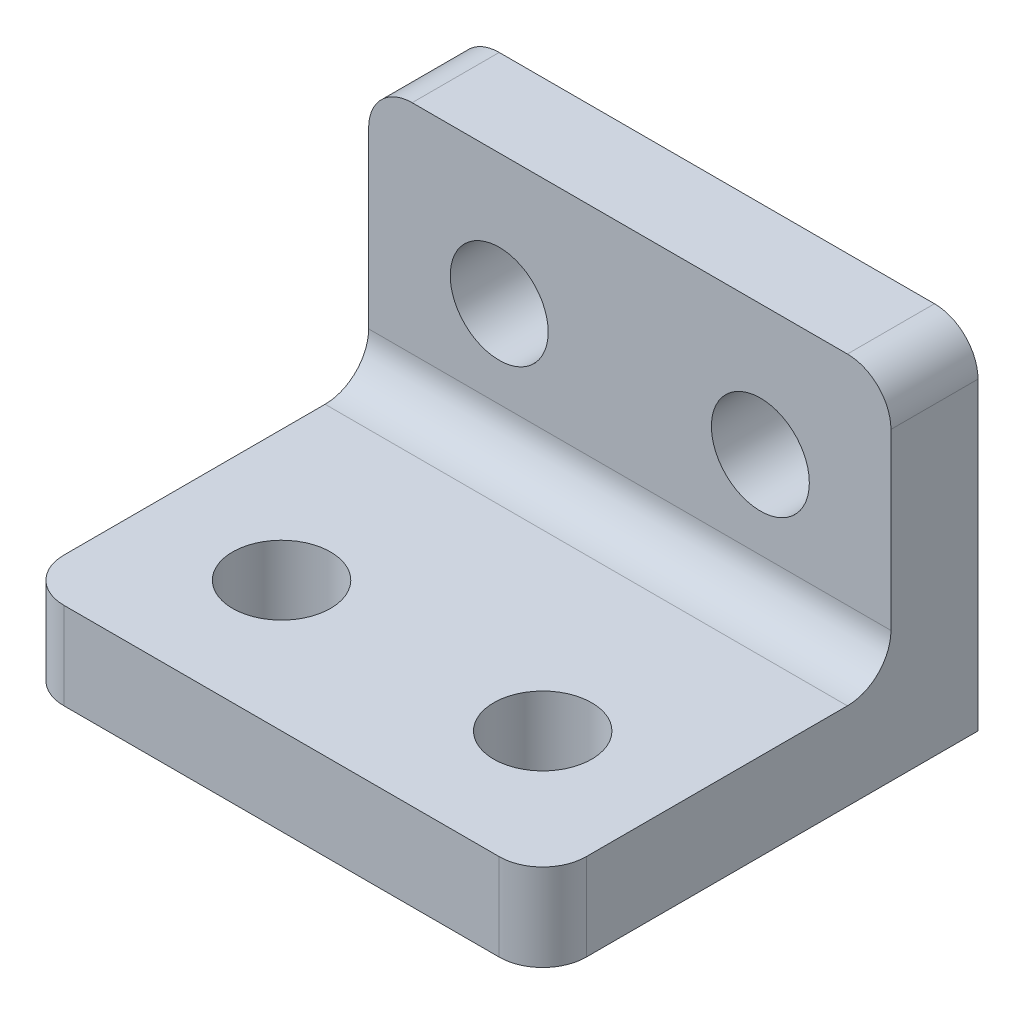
ISO-10303-21;
HEADER;
FILE_DESCRIPTION(('STEP AP214'),'2;1');
FILE_NAME('part.step','',(''),(''),'','','');
FILE_SCHEMA(('AUTOMOTIVE_DESIGN { 1 0 10303 214 1 1 1 1 }'));
ENDSEC;
DATA;
#1=APPLICATION_CONTEXT('core data for automotive mechanical design processes');
#2=APPLICATION_PROTOCOL_DEFINITION('international standard','automotive_design',2000,#1);
#3=PRODUCT_CONTEXT('',#1,'mechanical');
#4=PRODUCT('Part','Part','',(#3));
#5=PRODUCT_RELATED_PRODUCT_CATEGORY('part','',(#4));
#6=PRODUCT_DEFINITION_FORMATION('','',#4);
#7=PRODUCT_DEFINITION_CONTEXT('part definition',#1,'design');
#8=PRODUCT_DEFINITION('design','',#6,#7);
#9=PRODUCT_DEFINITION_SHAPE('','',#8);
#10=(LENGTH_UNIT() NAMED_UNIT(*) SI_UNIT(.MILLI.,.METRE.));
#11=(NAMED_UNIT(*) PLANE_ANGLE_UNIT() SI_UNIT($,.RADIAN.));
#12=(NAMED_UNIT(*) SI_UNIT($,.STERADIAN.) SOLID_ANGLE_UNIT());
#13=UNCERTAINTY_MEASURE_WITH_UNIT(LENGTH_MEASURE(1.E-05),#10,'distance_accuracy_value','');
#14=(GEOMETRIC_REPRESENTATION_CONTEXT(3) GLOBAL_UNCERTAINTY_ASSIGNED_CONTEXT((#13)) GLOBAL_UNIT_ASSIGNED_CONTEXT((#10,
#11,#12)) REPRESENTATION_CONTEXT('',''));
#15=CARTESIAN_POINT('',(0.,0.,0.));
#16=DIRECTION('',(0.,0.,1.));
#17=DIRECTION('',(1.,0.,0.));
#18=AXIS2_PLACEMENT_3D('',#15,#16,#17);
#19=CARTESIAN_POINT('',(0.,0.,6.35));
#20=DIRECTION('',(0.,0.,-1.));
#21=DIRECTION('',(-1.,0.,0.));
#22=AXIS2_PLACEMENT_3D('',#19,#20,#21);
#23=PLANE('',#22);
#24=CARTESIAN_POINT('',(9.525,3.175,6.35));
#25=DIRECTION('',(0.,0.,1.));
#26=DIRECTION('',(1.,0.,0.));
#27=AXIS2_PLACEMENT_3D('',#24,#25,#26);
#28=CIRCLE('',#27,3.571875);
#29=CARTESIAN_POINT('',(13.096875,3.175,6.35));
#30=VERTEX_POINT('',#29);
#31=EDGE_CURVE('E246',#30,#30,#28,.T.);
#32=ORIENTED_EDGE('',*,*,#31,.F.);
#33=EDGE_LOOP('',(#32));
#34=FACE_BOUND('',#33,.T.);
#35=CARTESIAN_POINT('',(-9.525,3.175,6.35));
#36=DIRECTION('',(0.,0.,1.));
#37=DIRECTION('',(1.,0.,0.));
#38=AXIS2_PLACEMENT_3D('',#35,#36,#37);
#39=CIRCLE('',#38,3.571875);
#40=CARTESIAN_POINT('',(-5.95312500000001,3.175,6.35));
#41=VERTEX_POINT('',#40);
#42=EDGE_CURVE('E256',#41,#41,#39,.T.);
#43=ORIENTED_EDGE('',*,*,#42,.F.);
#44=EDGE_LOOP('',(#43));
#45=FACE_BOUND('',#44,.T.);
#46=DIRECTION('',(0.,-1.,0.));
#47=VECTOR('',#46,1.);
#48=CARTESIAN_POINT('',(-19.05,-12.7,6.35));
#49=LINE('',#48,#47);
#50=CARTESIAN_POINT('',(-19.05,9.525,6.35));
#51=VERTEX_POINT('',#50);
#52=CARTESIAN_POINT('',(-19.05,-3.175,6.35));
#53=VERTEX_POINT('',#52);
#54=EDGE_CURVE('E162',#51,#53,#49,.T.);
#55=ORIENTED_EDGE('',*,*,#54,.T.);
#56=DIRECTION('',(-1.,0.,0.));
#57=VECTOR('',#56,1.);
#58=CARTESIAN_POINT('',(19.05,-3.175,6.35));
#59=LINE('',#58,#57);
#60=CARTESIAN_POINT('',(19.05,-3.175,6.35));
#61=VERTEX_POINT('',#60);
#62=EDGE_CURVE('E203',#53,#61,#59,.F.);
#63=ORIENTED_EDGE('',*,*,#62,.T.);
#64=DIRECTION('',(0.,1.,0.));
#65=VECTOR('',#64,1.);
#66=CARTESIAN_POINT('',(19.05,-12.7,6.35));
#67=LINE('',#66,#65);
#68=CARTESIAN_POINT('',(19.05,9.525,6.35));
#69=VERTEX_POINT('',#68);
#70=EDGE_CURVE('E153',#61,#69,#67,.T.);
#71=ORIENTED_EDGE('',*,*,#70,.T.);
#72=CARTESIAN_POINT('',(15.875,9.525,6.35));
#73=DIRECTION('',(0.,0.,-1.));
#74=DIRECTION('',(-1.,0.,0.));
#75=AXIS2_PLACEMENT_3D('',#72,#73,#74);
#76=CIRCLE('',#75,3.175);
#77=CARTESIAN_POINT('',(15.875,12.7,6.35));
#78=VERTEX_POINT('',#77);
#79=EDGE_CURVE('E200',#69,#78,#76,.F.);
#80=ORIENTED_EDGE('',*,*,#79,.T.);
#81=DIRECTION('',(-1.,0.,0.));
#82=VECTOR('',#81,1.);
#83=CARTESIAN_POINT('',(-19.05,12.7,6.35));
#84=LINE('',#83,#82);
#85=CARTESIAN_POINT('',(-15.875,12.7,6.35));
#86=VERTEX_POINT('',#85);
#87=EDGE_CURVE('E157',#78,#86,#84,.T.);
#88=ORIENTED_EDGE('',*,*,#87,.T.);
#89=CARTESIAN_POINT('',(-15.875,9.525,6.35));
#90=DIRECTION('',(0.,0.,-1.));
#91=DIRECTION('',(-1.,0.,0.));
#92=AXIS2_PLACEMENT_3D('',#89,#90,#91);
#93=CIRCLE('',#92,3.175);
#94=EDGE_CURVE('E197',#86,#51,#93,.F.);
#95=ORIENTED_EDGE('',*,*,#94,.T.);
#96=EDGE_LOOP('',(#55,#63,#71,#80,#88,#95));
#97=FACE_BOUND('',#96,.T.);
#98=ADVANCED_FACE('F39',(#34,#45,#97),#23,.F.);
#99=CARTESIAN_POINT('',(0.,0.,0.));
#100=DIRECTION('',(0.,0.,-1.));
#101=DIRECTION('',(-1.,0.,0.));
#102=AXIS2_PLACEMENT_3D('',#99,#100,#101);
#103=PLANE('',#102);
#104=CARTESIAN_POINT('',(-9.525,3.175,0.));
#105=DIRECTION('',(0.,0.,1.));
#106=DIRECTION('',(1.,0.,0.));
#107=AXIS2_PLACEMENT_3D('',#104,#105,#106);
#108=CIRCLE('',#107,3.571875);
#109=CARTESIAN_POINT('',(-5.95312500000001,3.175,0.));
#110=VERTEX_POINT('',#109);
#111=EDGE_CURVE('E254',#110,#110,#108,.T.);
#112=ORIENTED_EDGE('',*,*,#111,.T.);
#113=EDGE_LOOP('',(#112));
#114=FACE_BOUND('',#113,.T.);
#115=DIRECTION('',(-1.,0.,0.));
#116=VECTOR('',#115,1.);
#117=CARTESIAN_POINT('',(-19.05,12.7,0.));
#118=LINE('',#117,#116);
#119=CARTESIAN_POINT('',(15.875,12.7,0.));
#120=VERTEX_POINT('',#119);
#121=CARTESIAN_POINT('',(-15.875,12.7,0.));
#122=VERTEX_POINT('',#121);
#123=EDGE_CURVE('E135',#120,#122,#118,.T.);
#124=ORIENTED_EDGE('',*,*,#123,.F.);
#125=CARTESIAN_POINT('',(15.875,9.525,0.));
#126=DIRECTION('',(0.,0.,-1.));
#127=DIRECTION('',(-1.,0.,0.));
#128=AXIS2_PLACEMENT_3D('',#125,#126,#127);
#129=CIRCLE('',#128,3.175);
#130=CARTESIAN_POINT('',(19.05,9.525,0.));
#131=VERTEX_POINT('',#130);
#132=EDGE_CURVE('E63',#120,#131,#129,.T.);
#133=ORIENTED_EDGE('',*,*,#132,.T.);
#134=DIRECTION('',(0.,1.,0.));
#135=VECTOR('',#134,1.);
#136=CARTESIAN_POINT('',(19.05,-12.7,0.));
#137=LINE('',#136,#135);
#138=CARTESIAN_POINT('',(19.05,-12.7,0.));
#139=VERTEX_POINT('',#138);
#140=EDGE_CURVE('E151',#139,#131,#137,.T.);
#141=ORIENTED_EDGE('',*,*,#140,.F.);
#142=DIRECTION('',(1.,0.,0.));
#143=VECTOR('',#142,1.);
#144=CARTESIAN_POINT('',(-19.05,-12.7,0.));
#145=LINE('',#144,#143);
#146=CARTESIAN_POINT('',(-19.05,-12.7,0.));
#147=VERTEX_POINT('',#146);
#148=EDGE_CURVE('E134',#147,#139,#145,.T.);
#149=ORIENTED_EDGE('',*,*,#148,.F.);
#150=DIRECTION('',(0.,-1.,0.));
#151=VECTOR('',#150,1.);
#152=CARTESIAN_POINT('',(-19.05,-12.7,0.));
#153=LINE('',#152,#151);
#154=CARTESIAN_POINT('',(-19.05,9.525,0.));
#155=VERTEX_POINT('',#154);
#156=EDGE_CURVE('E124',#155,#147,#153,.T.);
#157=ORIENTED_EDGE('',*,*,#156,.F.);
#158=CARTESIAN_POINT('',(-15.875,9.525,0.));
#159=DIRECTION('',(0.,0.,-1.));
#160=DIRECTION('',(-1.,0.,0.));
#161=AXIS2_PLACEMENT_3D('',#158,#159,#160);
#162=CIRCLE('',#161,3.175);
#163=EDGE_CURVE('E55',#155,#122,#162,.T.);
#164=ORIENTED_EDGE('',*,*,#163,.T.);
#165=EDGE_LOOP('',(#124,#133,#141,#149,#157,#164));
#166=FACE_BOUND('',#165,.T.);
#167=CARTESIAN_POINT('',(9.525,3.175,0.));
#168=DIRECTION('',(0.,0.,1.));
#169=DIRECTION('',(1.,0.,0.));
#170=AXIS2_PLACEMENT_3D('',#167,#168,#169);
#171=CIRCLE('',#170,3.571875);
#172=CARTESIAN_POINT('',(13.096875,3.175,0.));
#173=VERTEX_POINT('',#172);
#174=EDGE_CURVE('E241',#173,#173,#171,.T.);
#175=ORIENTED_EDGE('',*,*,#174,.T.);
#176=EDGE_LOOP('',(#175));
#177=FACE_BOUND('',#176,.T.);
#178=ADVANCED_FACE('F148',(#114,#166,#177),#103,.T.);
#179=CARTESIAN_POINT('',(19.05,-12.7,6.35));
#180=DIRECTION('',(-1.,0.,0.));
#181=DIRECTION('',(0.,0.,1.));
#182=AXIS2_PLACEMENT_3D('',#179,#180,#181);
#183=PLANE('',#182);
#184=DIRECTION('',(0.,0.,-1.));
#185=VECTOR('',#184,1.);
#186=CARTESIAN_POINT('',(19.05,-6.35,31.75));
#187=LINE('',#186,#185);
#188=CARTESIAN_POINT('',(19.05,-6.35,28.575));
#189=VERTEX_POINT('',#188);
#190=CARTESIAN_POINT('',(19.05,-6.35,9.525));
#191=VERTEX_POINT('',#190);
#192=EDGE_CURVE('E235',#189,#191,#187,.T.);
#193=ORIENTED_EDGE('',*,*,#192,.F.);
#194=DIRECTION('',(0.,1.,0.));
#195=VECTOR('',#194,1.);
#196=CARTESIAN_POINT('',(19.05,-12.7,28.575));
#197=LINE('',#196,#195);
#198=CARTESIAN_POINT('',(19.05,-12.7,28.575));
#199=VERTEX_POINT('',#198);
#200=EDGE_CURVE('E184',#189,#199,#197,.F.);
#201=ORIENTED_EDGE('',*,*,#200,.T.);
#202=DIRECTION('',(0.,0.,-1.));
#203=VECTOR('',#202,1.);
#204=CARTESIAN_POINT('',(19.05,-12.7,6.35));
#205=LINE('',#204,#203);
#206=EDGE_CURVE('E146',#199,#139,#205,.T.);
#207=ORIENTED_EDGE('',*,*,#206,.T.);
#208=ORIENTED_EDGE('',*,*,#140,.T.);
#209=DIRECTION('',(0.,0.,-1.));
#210=VECTOR('',#209,1.);
#211=CARTESIAN_POINT('',(19.05,9.525,6.35));
#212=LINE('',#211,#210);
#213=EDGE_CURVE('E181',#131,#69,#212,.F.);
#214=ORIENTED_EDGE('',*,*,#213,.T.);
#215=ORIENTED_EDGE('',*,*,#70,.F.);
#216=CARTESIAN_POINT('',(19.05,-3.175,9.525));
#217=DIRECTION('',(-1.,0.,0.));
#218=DIRECTION('',(0.,0.,1.));
#219=AXIS2_PLACEMENT_3D('',#216,#217,#218);
#220=CIRCLE('',#219,3.175);
#221=EDGE_CURVE('E11',#61,#191,#220,.T.);
#222=ORIENTED_EDGE('',*,*,#221,.T.);
#223=EDGE_LOOP('',(#193,#201,#207,#208,#214,#215,#222));
#224=FACE_BOUND('',#223,.T.);
#225=ADVANCED_FACE('F234',(#224),#183,.F.);
#226=CARTESIAN_POINT('',(-19.05,12.7,6.35));
#227=DIRECTION('',(0.,-1.,0.));
#228=DIRECTION('',(0.,0.,-1.));
#229=AXIS2_PLACEMENT_3D('',#226,#227,#228);
#230=PLANE('',#229);
#231=ORIENTED_EDGE('',*,*,#87,.F.);
#232=DIRECTION('',(0.,0.,-1.));
#233=VECTOR('',#232,1.);
#234=CARTESIAN_POINT('',(15.875,12.7,6.35));
#235=LINE('',#234,#233);
#236=EDGE_CURVE('E209',#78,#120,#235,.T.);
#237=ORIENTED_EDGE('',*,*,#236,.T.);
#238=ORIENTED_EDGE('',*,*,#123,.T.);
#239=DIRECTION('',(0.,0.,-1.));
#240=VECTOR('',#239,1.);
#241=CARTESIAN_POINT('',(-15.875,12.7,6.35));
#242=LINE('',#241,#240);
#243=EDGE_CURVE('E206',#122,#86,#242,.F.);
#244=ORIENTED_EDGE('',*,*,#243,.T.);
#245=EDGE_LOOP('',(#231,#237,#238,#244));
#246=FACE_BOUND('',#245,.T.);
#247=ADVANCED_FACE('F270',(#246),#230,.F.);
#248=CARTESIAN_POINT('',(-19.05,-12.7,6.35));
#249=DIRECTION('',(1.,0.,0.));
#250=DIRECTION('',(0.,0.,-1.));
#251=AXIS2_PLACEMENT_3D('',#248,#249,#250);
#252=PLANE('',#251);
#253=DIRECTION('',(0.,0.,-1.));
#254=VECTOR('',#253,1.);
#255=CARTESIAN_POINT('',(-19.05,-12.7,6.35));
#256=LINE('',#255,#254);
#257=CARTESIAN_POINT('',(-19.05,-12.7,28.575));
#258=VERTEX_POINT('',#257);
#259=EDGE_CURVE('E127',#258,#147,#256,.T.);
#260=ORIENTED_EDGE('',*,*,#259,.F.);
#261=DIRECTION('',(0.,-1.,0.));
#262=VECTOR('',#261,1.);
#263=CARTESIAN_POINT('',(-19.05,-12.7,28.575));
#264=LINE('',#263,#262);
#265=CARTESIAN_POINT('',(-19.05,-6.35,28.575));
#266=VERTEX_POINT('',#265);
#267=EDGE_CURVE('E194',#258,#266,#264,.F.);
#268=ORIENTED_EDGE('',*,*,#267,.T.);
#269=DIRECTION('',(0.,0.,-1.));
#270=VECTOR('',#269,1.);
#271=CARTESIAN_POINT('',(-19.05,-6.35,31.75));
#272=LINE('',#271,#270);
#273=CARTESIAN_POINT('',(-19.05,-6.35,9.525));
#274=VERTEX_POINT('',#273);
#275=EDGE_CURVE('E219',#266,#274,#272,.T.);
#276=ORIENTED_EDGE('',*,*,#275,.T.);
#277=CARTESIAN_POINT('',(-19.05,-3.175,9.525));
#278=DIRECTION('',(1.,0.,0.));
#279=DIRECTION('',(0.,0.,-1.));
#280=AXIS2_PLACEMENT_3D('',#277,#278,#279);
#281=CIRCLE('',#280,3.175);
#282=EDGE_CURVE('E48',#274,#53,#281,.T.);
#283=ORIENTED_EDGE('',*,*,#282,.T.);
#284=ORIENTED_EDGE('',*,*,#54,.F.);
#285=DIRECTION('',(0.,0.,-1.));
#286=VECTOR('',#285,1.);
#287=CARTESIAN_POINT('',(-19.05,9.525,6.35));
#288=LINE('',#287,#286);
#289=EDGE_CURVE('E131',#51,#155,#288,.T.);
#290=ORIENTED_EDGE('',*,*,#289,.T.);
#291=ORIENTED_EDGE('',*,*,#156,.T.);
#292=EDGE_LOOP('',(#260,#268,#276,#283,#284,#290,#291));
#293=FACE_BOUND('',#292,.T.);
#294=ADVANCED_FACE('F126',(#293),#252,.F.);
#295=CARTESIAN_POINT('',(-19.05,-12.7,6.35));
#296=DIRECTION('',(0.,1.,0.));
#297=DIRECTION('',(0.,0.,1.));
#298=AXIS2_PLACEMENT_3D('',#295,#296,#297);
#299=PLANE('',#298);
#300=CARTESIAN_POINT('',(-9.525,-12.7,22.225));
#301=DIRECTION('',(0.,1.,0.));
#302=DIRECTION('',(0.,0.,1.));
#303=AXIS2_PLACEMENT_3D('',#300,#301,#302);
#304=CIRCLE('',#303,3.571875);
#305=CARTESIAN_POINT('',(-9.525,-12.7,25.796875));
#306=VERTEX_POINT('',#305);
#307=EDGE_CURVE('E460',#306,#306,#304,.T.);
#308=ORIENTED_EDGE('',*,*,#307,.T.);
#309=EDGE_LOOP('',(#308));
#310=FACE_BOUND('',#309,.T.);
#311=CARTESIAN_POINT('',(9.525,-12.7,22.225));
#312=DIRECTION('',(0.,1.,0.));
#313=DIRECTION('',(0.,0.,1.));
#314=AXIS2_PLACEMENT_3D('',#311,#312,#313);
#315=CIRCLE('',#314,3.571875);
#316=CARTESIAN_POINT('',(9.525,-12.7,25.796875));
#317=VERTEX_POINT('',#316);
#318=EDGE_CURVE('E450',#317,#317,#315,.T.);
#319=ORIENTED_EDGE('',*,*,#318,.T.);
#320=EDGE_LOOP('',(#319));
#321=FACE_BOUND('',#320,.T.);
#322=ORIENTED_EDGE('',*,*,#206,.F.);
#323=CARTESIAN_POINT('',(15.875,-12.7,28.575));
#324=DIRECTION('',(0.,1.,0.));
#325=DIRECTION('',(0.,0.,1.));
#326=AXIS2_PLACEMENT_3D('',#323,#324,#325);
#327=CIRCLE('',#326,3.175);
#328=CARTESIAN_POINT('',(15.875,-12.7,31.75));
#329=VERTEX_POINT('',#328);
#330=EDGE_CURVE('E189',#199,#329,#327,.F.);
#331=ORIENTED_EDGE('',*,*,#330,.T.);
#332=DIRECTION('',(1.,0.,0.));
#333=VECTOR('',#332,1.);
#334=CARTESIAN_POINT('',(-19.05,-12.7,31.75));
#335=LINE('',#334,#333);
#336=CARTESIAN_POINT('',(-15.875,-12.7,31.75));
#337=VERTEX_POINT('',#336);
#338=EDGE_CURVE('E457',#337,#329,#335,.T.);
#339=ORIENTED_EDGE('',*,*,#338,.F.);
#340=CARTESIAN_POINT('',(-15.875,-12.7,28.575));
#341=DIRECTION('',(0.,1.,0.));
#342=DIRECTION('',(0.,0.,1.));
#343=AXIS2_PLACEMENT_3D('',#340,#341,#342);
#344=CIRCLE('',#343,3.175);
#345=EDGE_CURVE('E143',#337,#258,#344,.F.);
#346=ORIENTED_EDGE('',*,*,#345,.T.);
#347=ORIENTED_EDGE('',*,*,#259,.T.);
#348=ORIENTED_EDGE('',*,*,#148,.T.);
#349=EDGE_LOOP('',(#322,#331,#339,#346,#347,#348));
#350=FACE_BOUND('',#349,.T.);
#351=ADVANCED_FACE('F140',(#310,#321,#350),#299,.F.);
#352=CARTESIAN_POINT('',(-9.525,3.175,6.35));
#353=DIRECTION('',(0.,0.,-1.));
#354=DIRECTION('',(-1.,0.,0.));
#355=AXIS2_PLACEMENT_3D('',#352,#353,#354);
#356=CYLINDRICAL_SURFACE('',#355,3.571875);
#357=ORIENTED_EDGE('',*,*,#42,.T.);
#358=EDGE_LOOP('',(#357));
#359=FACE_BOUND('',#358,.T.);
#360=ORIENTED_EDGE('',*,*,#111,.F.);
#361=EDGE_LOOP('',(#360));
#362=FACE_BOUND('',#361,.T.);
#363=ADVANCED_FACE('F288',(#359,#362),#356,.F.);
#364=CARTESIAN_POINT('',(9.525,3.175,6.35));
#365=DIRECTION('',(0.,0.,-1.));
#366=DIRECTION('',(-1.,0.,0.));
#367=AXIS2_PLACEMENT_3D('',#364,#365,#366);
#368=CYLINDRICAL_SURFACE('',#367,3.571875);
#369=ORIENTED_EDGE('',*,*,#31,.T.);
#370=EDGE_LOOP('',(#369));
#371=FACE_BOUND('',#370,.T.);
#372=ORIENTED_EDGE('',*,*,#174,.F.);
#373=EDGE_LOOP('',(#372));
#374=FACE_BOUND('',#373,.T.);
#375=ADVANCED_FACE('F370',(#371,#374),#368,.F.);
#376=CARTESIAN_POINT('',(-19.05,-6.35,31.75));
#377=DIRECTION('',(0.,-1.,0.));
#378=DIRECTION('',(0.,0.,-1.));
#379=AXIS2_PLACEMENT_3D('',#376,#377,#378);
#380=PLANE('',#379);
#381=CARTESIAN_POINT('',(-9.525,-6.35,22.225));
#382=DIRECTION('',(0.,1.,0.));
#383=DIRECTION('',(0.,0.,1.));
#384=AXIS2_PLACEMENT_3D('',#381,#382,#383);
#385=CIRCLE('',#384,3.571875);
#386=CARTESIAN_POINT('',(-9.525,-6.35,25.796875));
#387=VERTEX_POINT('',#386);
#388=EDGE_CURVE('E444',#387,#387,#385,.T.);
#389=ORIENTED_EDGE('',*,*,#388,.F.);
#390=EDGE_LOOP('',(#389));
#391=FACE_BOUND('',#390,.T.);
#392=CARTESIAN_POINT('',(9.525,-6.35,22.225));
#393=DIRECTION('',(0.,1.,0.));
#394=DIRECTION('',(0.,0.,1.));
#395=AXIS2_PLACEMENT_3D('',#392,#393,#394);
#396=CIRCLE('',#395,3.571875);
#397=CARTESIAN_POINT('',(9.525,-6.35,25.796875));
#398=VERTEX_POINT('',#397);
#399=EDGE_CURVE('E447',#398,#398,#396,.T.);
#400=ORIENTED_EDGE('',*,*,#399,.F.);
#401=EDGE_LOOP('',(#400));
#402=FACE_BOUND('',#401,.T.);
#403=DIRECTION('',(-1.,0.,0.));
#404=VECTOR('',#403,1.);
#405=CARTESIAN_POINT('',(-19.05,-6.35,31.75));
#406=LINE('',#405,#404);
#407=CARTESIAN_POINT('',(15.875,-6.35,31.75));
#408=VERTEX_POINT('',#407);
#409=CARTESIAN_POINT('',(-15.875,-6.35,31.75));
#410=VERTEX_POINT('',#409);
#411=EDGE_CURVE('E248',#408,#410,#406,.T.);
#412=ORIENTED_EDGE('',*,*,#411,.F.);
#413=CARTESIAN_POINT('',(15.875,-6.35,28.575));
#414=DIRECTION('',(0.,-1.,0.));
#415=DIRECTION('',(0.,0.,-1.));
#416=AXIS2_PLACEMENT_3D('',#413,#414,#415);
#417=CIRCLE('',#416,3.175);
#418=EDGE_CURVE('E178',#408,#189,#417,.F.);
#419=ORIENTED_EDGE('',*,*,#418,.T.);
#420=ORIENTED_EDGE('',*,*,#192,.T.);
#421=DIRECTION('',(-1.,0.,0.));
#422=VECTOR('',#421,1.);
#423=CARTESIAN_POINT('',(-19.05,-6.35,9.525));
#424=LINE('',#423,#422);
#425=EDGE_CURVE('E171',#191,#274,#424,.T.);
#426=ORIENTED_EDGE('',*,*,#425,.T.);
#427=ORIENTED_EDGE('',*,*,#275,.F.);
#428=CARTESIAN_POINT('',(-15.875,-6.35,28.575));
#429=DIRECTION('',(0.,-1.,0.));
#430=DIRECTION('',(0.,0.,-1.));
#431=AXIS2_PLACEMENT_3D('',#428,#429,#430);
#432=CIRCLE('',#431,3.175);
#433=EDGE_CURVE('E175',#266,#410,#432,.F.);
#434=ORIENTED_EDGE('',*,*,#433,.T.);
#435=EDGE_LOOP('',(#412,#419,#420,#426,#427,#434));
#436=FACE_BOUND('',#435,.T.);
#437=ADVANCED_FACE('F239',(#391,#402,#436),#380,.F.);
#438=CARTESIAN_POINT('',(0.,0.,31.75));
#439=DIRECTION('',(0.,0.,-1.));
#440=DIRECTION('',(-1.,0.,0.));
#441=AXIS2_PLACEMENT_3D('',#438,#439,#440);
#442=PLANE('',#441);
#443=ORIENTED_EDGE('',*,*,#338,.T.);
#444=DIRECTION('',(0.,1.,0.));
#445=VECTOR('',#444,1.);
#446=CARTESIAN_POINT('',(15.875,0.,31.75));
#447=LINE('',#446,#445);
#448=EDGE_CURVE('E167',#329,#408,#447,.T.);
#449=ORIENTED_EDGE('',*,*,#448,.T.);
#450=ORIENTED_EDGE('',*,*,#411,.T.);
#451=DIRECTION('',(0.,-1.,0.));
#452=VECTOR('',#451,1.);
#453=CARTESIAN_POINT('',(-15.875,0.,31.75));
#454=LINE('',#453,#452);
#455=EDGE_CURVE('E145',#410,#337,#454,.T.);
#456=ORIENTED_EDGE('',*,*,#455,.T.);
#457=EDGE_LOOP('',(#443,#449,#450,#456));
#458=FACE_BOUND('',#457,.T.);
#459=ADVANCED_FACE('F353',(#458),#442,.F.);
#460=CARTESIAN_POINT('',(9.525,-12.7,22.225));
#461=DIRECTION('',(0.,1.,0.));
#462=DIRECTION('',(0.,0.,1.));
#463=AXIS2_PLACEMENT_3D('',#460,#461,#462);
#464=CYLINDRICAL_SURFACE('',#463,3.571875);
#465=ORIENTED_EDGE('',*,*,#318,.F.);
#466=EDGE_LOOP('',(#465));
#467=FACE_BOUND('',#466,.T.);
#468=ORIENTED_EDGE('',*,*,#399,.T.);
#469=EDGE_LOOP('',(#468));
#470=FACE_BOUND('',#469,.T.);
#471=ADVANCED_FACE('F344',(#467,#470),#464,.F.);
#472=CARTESIAN_POINT('',(-9.525,-12.7,22.225));
#473=DIRECTION('',(0.,1.,0.));
#474=DIRECTION('',(0.,0.,1.));
#475=AXIS2_PLACEMENT_3D('',#472,#473,#474);
#476=CYLINDRICAL_SURFACE('',#475,3.571875);
#477=ORIENTED_EDGE('',*,*,#307,.F.);
#478=EDGE_LOOP('',(#477));
#479=FACE_BOUND('',#478,.T.);
#480=ORIENTED_EDGE('',*,*,#388,.T.);
#481=EDGE_LOOP('',(#480));
#482=FACE_BOUND('',#481,.T.);
#483=ADVANCED_FACE('F304',(#479,#482),#476,.F.);
#484=CARTESIAN_POINT('',(15.875,0.,28.575));
#485=DIRECTION('',(0.,1.,0.));
#486=DIRECTION('',(0.,0.,1.));
#487=AXIS2_PLACEMENT_3D('',#484,#485,#486);
#488=CYLINDRICAL_SURFACE('',#487,3.175);
#489=ORIENTED_EDGE('',*,*,#330,.F.);
#490=ORIENTED_EDGE('',*,*,#200,.F.);
#491=ORIENTED_EDGE('',*,*,#418,.F.);
#492=ORIENTED_EDGE('',*,*,#448,.F.);
#493=EDGE_LOOP('',(#489,#490,#491,#492));
#494=FACE_BOUND('',#493,.T.);
#495=ADVANCED_FACE('F300',(#494),#488,.T.);
#496=CARTESIAN_POINT('',(-15.875,0.,28.575));
#497=DIRECTION('',(0.,-1.,0.));
#498=DIRECTION('',(0.,0.,-1.));
#499=AXIS2_PLACEMENT_3D('',#496,#497,#498);
#500=CYLINDRICAL_SURFACE('',#499,3.175);
#501=ORIENTED_EDGE('',*,*,#433,.F.);
#502=ORIENTED_EDGE('',*,*,#267,.F.);
#503=ORIENTED_EDGE('',*,*,#345,.F.);
#504=ORIENTED_EDGE('',*,*,#455,.F.);
#505=EDGE_LOOP('',(#501,#502,#503,#504));
#506=FACE_BOUND('',#505,.T.);
#507=ADVANCED_FACE('F303',(#506),#500,.T.);
#508=CARTESIAN_POINT('',(-19.05,-3.175,9.525));
#509=DIRECTION('',(1.,0.,0.));
#510=DIRECTION('',(0.,0.,-1.));
#511=AXIS2_PLACEMENT_3D('',#508,#509,#510);
#512=CYLINDRICAL_SURFACE('',#511,3.175);
#513=ORIENTED_EDGE('',*,*,#221,.F.);
#514=ORIENTED_EDGE('',*,*,#62,.F.);
#515=ORIENTED_EDGE('',*,*,#282,.F.);
#516=ORIENTED_EDGE('',*,*,#425,.F.);
#517=EDGE_LOOP('',(#513,#514,#515,#516));
#518=FACE_BOUND('',#517,.T.);
#519=ADVANCED_FACE('F230',(#518),#512,.F.);
#520=CARTESIAN_POINT('',(15.875,9.525,6.35));
#521=DIRECTION('',(0.,0.,-1.));
#522=DIRECTION('',(-1.,0.,0.));
#523=AXIS2_PLACEMENT_3D('',#520,#521,#522);
#524=CYLINDRICAL_SURFACE('',#523,3.175);
#525=ORIENTED_EDGE('',*,*,#79,.F.);
#526=ORIENTED_EDGE('',*,*,#213,.F.);
#527=ORIENTED_EDGE('',*,*,#132,.F.);
#528=ORIENTED_EDGE('',*,*,#236,.F.);
#529=EDGE_LOOP('',(#525,#526,#527,#528));
#530=FACE_BOUND('',#529,.T.);
#531=ADVANCED_FACE('F273',(#530),#524,.T.);
#532=CARTESIAN_POINT('',(-15.875,9.525,6.35));
#533=DIRECTION('',(0.,0.,-1.));
#534=DIRECTION('',(-1.,0.,0.));
#535=AXIS2_PLACEMENT_3D('',#532,#533,#534);
#536=CYLINDRICAL_SURFACE('',#535,3.175);
#537=ORIENTED_EDGE('',*,*,#94,.F.);
#538=ORIENTED_EDGE('',*,*,#243,.F.);
#539=ORIENTED_EDGE('',*,*,#163,.F.);
#540=ORIENTED_EDGE('',*,*,#289,.F.);
#541=EDGE_LOOP('',(#537,#538,#539,#540));
#542=FACE_BOUND('',#541,.T.);
#543=ADVANCED_FACE('F41',(#542),#536,.T.);
#544=CLOSED_SHELL('',(#98,#178,#225,#247,#294,#351,#363,#375,#437,#459,#471,#483,#495,#507,#519,
#531,#543));
#545=MANIFOLD_SOLID_BREP('B2',#544);
#546=ADVANCED_BREP_SHAPE_REPRESENTATION('',(#18,#545),#14);
#547=SHAPE_DEFINITION_REPRESENTATION(#9,#546);
ENDSEC;
END-ISO-10303-21;
